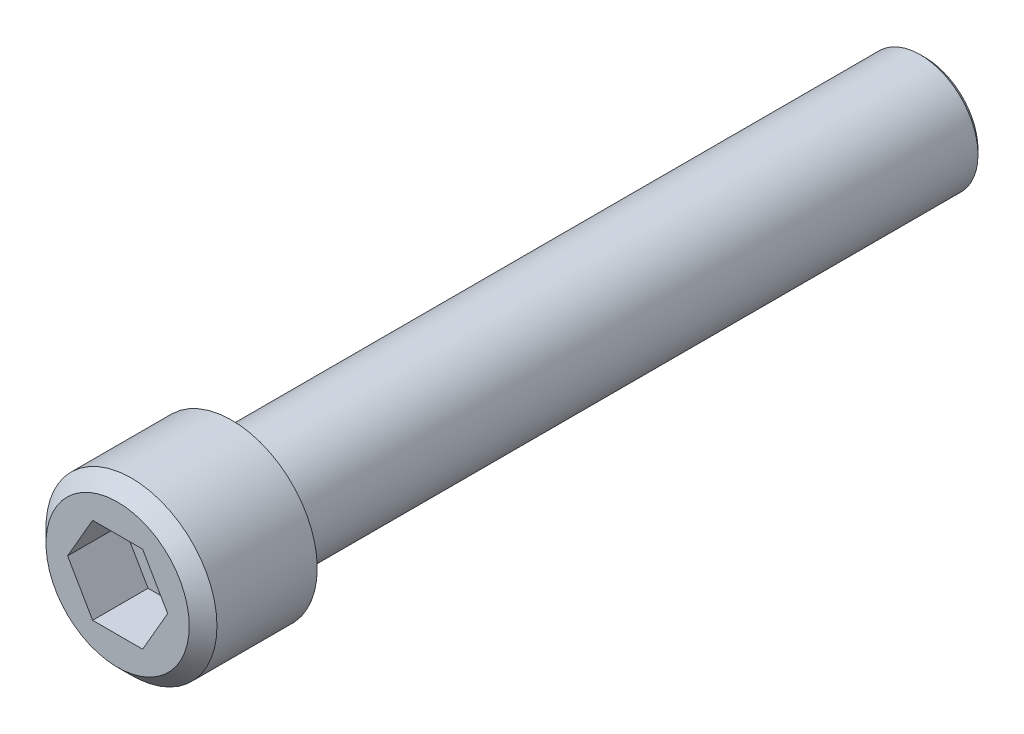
from build123d import *

# Parameters (mm, degrees)
SKETCH1_R           = 4.699
HEAD_DEPTH          = 6.2738
SKETCH2_R           = 3.175
SHANK_DEPTH         = 38.1
SOCKET_DEPTH        = 3.048
BOTTOM_CHAMFER_SIZE = 0.254
TOP_CHAMFER_SIZE    = 0.762


with BuildPart() as part:
    # Sketch1 → Head (new body)
    with BuildSketch(Plane.XY):
        Circle(SKETCH1_R)
    extrude(amount=-HEAD_DEPTH)

    # Sketch2 → Shank (add)
    with BuildSketch(Plane(origin=(0, 0, -6.2738), x_dir=(-1, 0, 0), z_dir=(0, 0, -1))):
        with Locations(Location((0, 0, 0), (0, 0, 180))):
            Circle(SKETCH2_R)
    extrude(amount=SHANK_DEPTH)

    # Sketch3 → Socket (cut)
    with BuildSketch(Plane.XY):
        Polygon((2.749630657, 0), (1.374815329, 2.38125), (-1.374815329, 2.38125), (-2.749630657, 0), (-1.374815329, -2.38125), (1.374815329, -2.38125), align=None)
    extrude(amount=-SOCKET_DEPTH, mode=Mode.SUBTRACT)

    # Bottom Chamfer
    bottom_chamfer_edges = [part.edges().sort_by_distance(p)[0] for p in [
        (-3.175, 0, -44.3738),
    ]]
    chamfer(bottom_chamfer_edges, length=BOTTOM_CHAMFER_SIZE)

    # Top Chamfer
    top_chamfer_edges = [part.edges().sort_by_distance(p)[0] for p in [
        (-4.699, 0, 0),
    ]]
    chamfer(top_chamfer_edges, length=TOP_CHAMFER_SIZE)


solid = part.part
